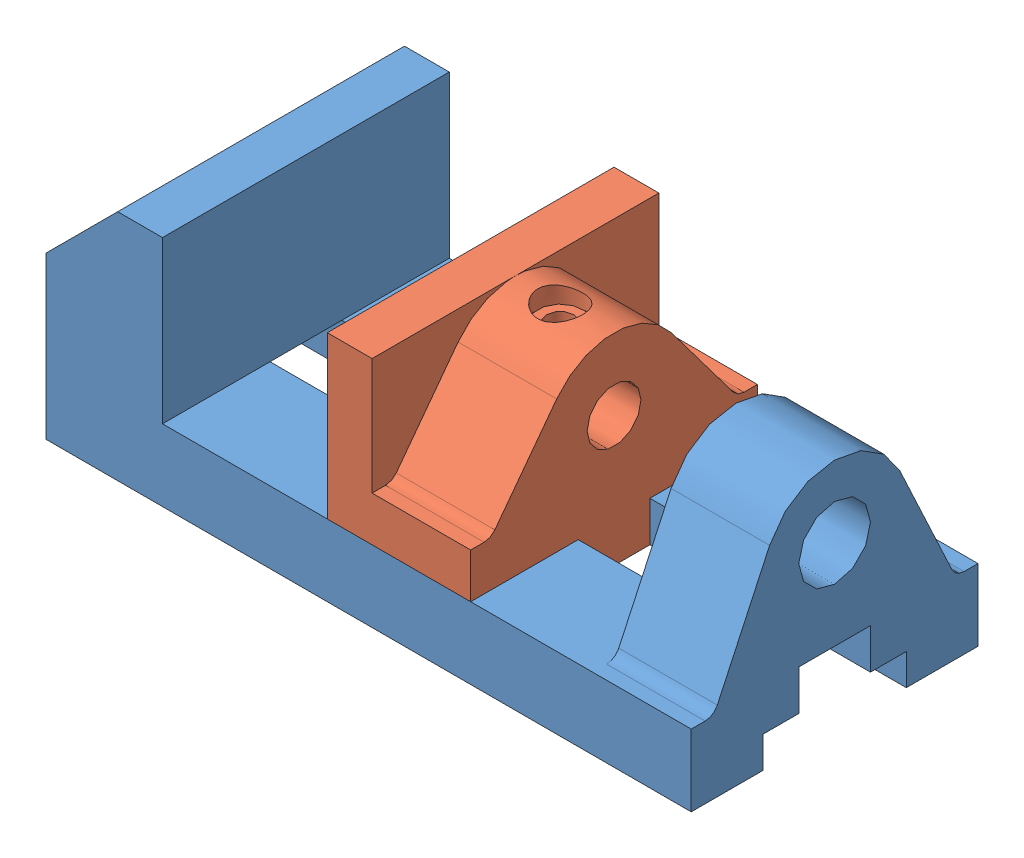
SolidWorks assembly Assem.SLDASM, configuration Default (file format 8000). Lengths in mm.
Overall size (144 52 64).
2 component instances, 2 part files, 2 mates.
Components (placement in the parent):
- vice-body-1: vice-body.SLDPRT [Default] at (-137.3635 -16.3934 27.9648) size (144 52 64)
- vice-jaw-2: vice-jaw.SLDPRT [Default] at (-74.5893 13.6066 27.9648) x (0 0 -1) z (1 0 0) size (64 45 32)
Mates (geometry in assembly coordinates):
- Coincident10: coincident aligned: plane of vice-body-1 through (-137.3635 -16.3934 59.9648) normal (0 0 1); plane of vice-jaw-2 through (-42.5893 35.6066 59.9648) normal (0 0 1)
- Coincident11: coincident anti-aligned: plane of vice-body-1 through (6.6365 -0.3934 59.9648) normal (0 1 0); plane of vice-jaw-2 through (-42.5893 -0.3934 59.9648) normal (0 -1 0)
